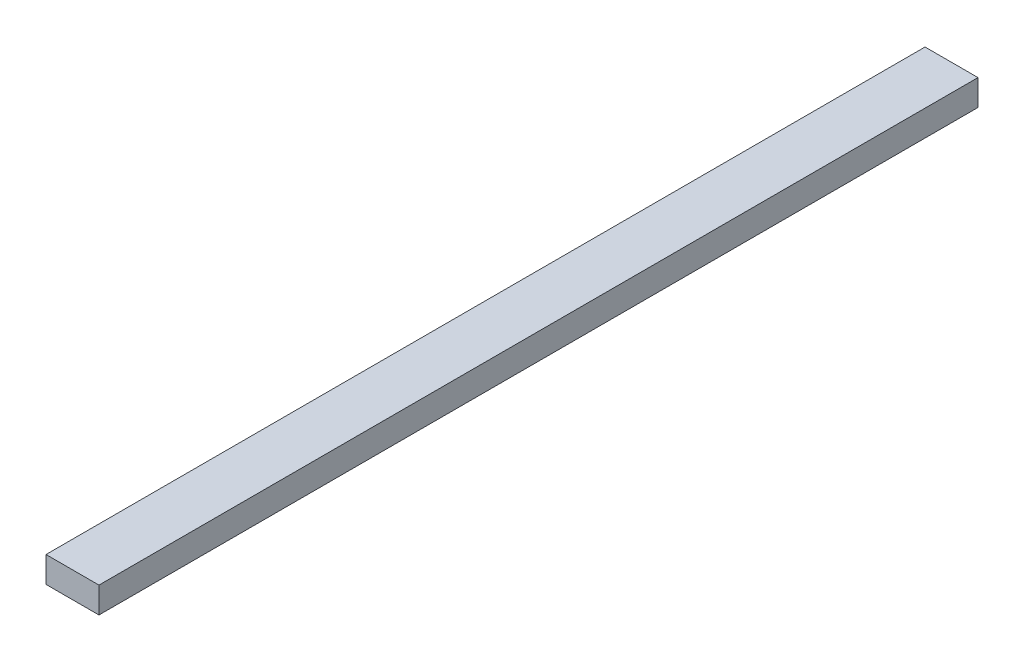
ISO-10303-21;
HEADER;
FILE_DESCRIPTION(('STEP AP214'),'2;1');
FILE_NAME('part.step','',(''),(''),'','','');
FILE_SCHEMA(('AUTOMOTIVE_DESIGN { 1 0 10303 214 1 1 1 1 }'));
ENDSEC;
DATA;
#1=APPLICATION_CONTEXT('core data for automotive mechanical design processes');
#2=APPLICATION_PROTOCOL_DEFINITION('international standard','automotive_design',2000,#1);
#3=PRODUCT_CONTEXT('',#1,'mechanical');
#4=PRODUCT('Part','Part','',(#3));
#5=PRODUCT_RELATED_PRODUCT_CATEGORY('part','',(#4));
#6=PRODUCT_DEFINITION_FORMATION('','',#4);
#7=PRODUCT_DEFINITION_CONTEXT('part definition',#1,'design');
#8=PRODUCT_DEFINITION('design','',#6,#7);
#9=PRODUCT_DEFINITION_SHAPE('','',#8);
#10=(LENGTH_UNIT() NAMED_UNIT(*) SI_UNIT(.MILLI.,.METRE.));
#11=(NAMED_UNIT(*) PLANE_ANGLE_UNIT() SI_UNIT($,.RADIAN.));
#12=(NAMED_UNIT(*) SI_UNIT($,.STERADIAN.) SOLID_ANGLE_UNIT());
#13=UNCERTAINTY_MEASURE_WITH_UNIT(LENGTH_MEASURE(1.E-05),#10,'distance_accuracy_value','');
#14=(GEOMETRIC_REPRESENTATION_CONTEXT(3) GLOBAL_UNCERTAINTY_ASSIGNED_CONTEXT((#13)) GLOBAL_UNIT_ASSIGNED_CONTEXT((#10,
#11,#12)) REPRESENTATION_CONTEXT('',''));
#15=CARTESIAN_POINT('',(0.,0.,0.));
#16=DIRECTION('',(0.,0.,1.));
#17=DIRECTION('',(1.,0.,0.));
#18=AXIS2_PLACEMENT_3D('',#15,#16,#17);
#19=CARTESIAN_POINT('',(23.5,11.5,780.));
#20=DIRECTION('',(-1.,0.,0.));
#21=DIRECTION('',(0.,0.,1.));
#22=AXIS2_PLACEMENT_3D('',#19,#20,#21);
#23=PLANE('',#22);
#24=DIRECTION('',(0.,1.,0.));
#25=VECTOR('',#24,1.);
#26=CARTESIAN_POINT('',(23.5,11.5,0.));
#27=LINE('',#26,#25);
#28=CARTESIAN_POINT('',(23.5,-11.5,0.));
#29=VERTEX_POINT('',#28);
#30=CARTESIAN_POINT('',(23.5,11.5,0.));
#31=VERTEX_POINT('',#30);
#32=EDGE_CURVE('E96',#29,#31,#27,.T.);
#33=ORIENTED_EDGE('',*,*,#32,.T.);
#34=DIRECTION('',(0.,0.,-1.));
#35=VECTOR('',#34,1.);
#36=CARTESIAN_POINT('',(23.5,11.5,780.));
#37=LINE('',#36,#35);
#38=CARTESIAN_POINT('',(23.5,11.5,780.));
#39=VERTEX_POINT('',#38);
#40=EDGE_CURVE('E11',#39,#31,#37,.T.);
#41=ORIENTED_EDGE('',*,*,#40,.F.);
#42=DIRECTION('',(0.,1.,0.));
#43=VECTOR('',#42,1.);
#44=CARTESIAN_POINT('',(23.5,11.5,780.));
#45=LINE('',#44,#43);
#46=CARTESIAN_POINT('',(23.5,-11.5,780.));
#47=VERTEX_POINT('',#46);
#48=EDGE_CURVE('E84',#47,#39,#45,.T.);
#49=ORIENTED_EDGE('',*,*,#48,.F.);
#50=DIRECTION('',(0.,0.,-1.));
#51=VECTOR('',#50,1.);
#52=CARTESIAN_POINT('',(23.5,-11.5,780.));
#53=LINE('',#52,#51);
#54=EDGE_CURVE('E92',#47,#29,#53,.T.);
#55=ORIENTED_EDGE('',*,*,#54,.T.);
#56=EDGE_LOOP('',(#33,#41,#49,#55));
#57=FACE_BOUND('',#56,.T.);
#58=ADVANCED_FACE('F33',(#57),#23,.F.);
#59=CARTESIAN_POINT('',(-23.5,11.5,780.));
#60=DIRECTION('',(0.,-1.,0.));
#61=DIRECTION('',(0.,0.,-1.));
#62=AXIS2_PLACEMENT_3D('',#59,#60,#61);
#63=PLANE('',#62);
#64=DIRECTION('',(-1.,0.,0.));
#65=VECTOR('',#64,1.);
#66=CARTESIAN_POINT('',(-23.5,11.5,0.));
#67=LINE('',#66,#65);
#68=CARTESIAN_POINT('',(-23.5,11.5,0.));
#69=VERTEX_POINT('',#68);
#70=EDGE_CURVE('E88',#31,#69,#67,.T.);
#71=ORIENTED_EDGE('',*,*,#70,.T.);
#72=DIRECTION('',(0.,0.,-1.));
#73=VECTOR('',#72,1.);
#74=CARTESIAN_POINT('',(-23.5,11.5,780.));
#75=LINE('',#74,#73);
#76=CARTESIAN_POINT('',(-23.5,11.5,780.));
#77=VERTEX_POINT('',#76);
#78=EDGE_CURVE('E41',#77,#69,#75,.T.);
#79=ORIENTED_EDGE('',*,*,#78,.F.);
#80=DIRECTION('',(-1.,0.,0.));
#81=VECTOR('',#80,1.);
#82=CARTESIAN_POINT('',(-23.5,11.5,780.));
#83=LINE('',#82,#81);
#84=EDGE_CURVE('E79',#39,#77,#83,.T.);
#85=ORIENTED_EDGE('',*,*,#84,.F.);
#86=ORIENTED_EDGE('',*,*,#40,.T.);
#87=EDGE_LOOP('',(#71,#79,#85,#86));
#88=FACE_BOUND('',#87,.T.);
#89=ADVANCED_FACE('F87',(#88),#63,.F.);
#90=CARTESIAN_POINT('',(-23.5,11.5,780.));
#91=DIRECTION('',(1.,0.,0.));
#92=DIRECTION('',(0.,1.,0.));
#93=AXIS2_PLACEMENT_3D('',#90,#91,#92);
#94=PLANE('',#93);
#95=DIRECTION('',(0.,-1.,0.));
#96=VECTOR('',#95,1.);
#97=CARTESIAN_POINT('',(-23.5,11.5,0.));
#98=LINE('',#97,#96);
#99=CARTESIAN_POINT('',(-23.5,-11.5,0.));
#100=VERTEX_POINT('',#99);
#101=EDGE_CURVE('E66',#69,#100,#98,.T.);
#102=ORIENTED_EDGE('',*,*,#101,.T.);
#103=DIRECTION('',(0.,0.,-1.));
#104=VECTOR('',#103,1.);
#105=CARTESIAN_POINT('',(-23.5,-11.5,780.));
#106=LINE('',#105,#104);
#107=CARTESIAN_POINT('',(-23.5,-11.5,780.));
#108=VERTEX_POINT('',#107);
#109=EDGE_CURVE('E89',#108,#100,#106,.T.);
#110=ORIENTED_EDGE('',*,*,#109,.F.);
#111=DIRECTION('',(0.,-1.,0.));
#112=VECTOR('',#111,1.);
#113=CARTESIAN_POINT('',(-23.5,11.5,780.));
#114=LINE('',#113,#112);
#115=EDGE_CURVE('E82',#77,#108,#114,.T.);
#116=ORIENTED_EDGE('',*,*,#115,.F.);
#117=ORIENTED_EDGE('',*,*,#78,.T.);
#118=EDGE_LOOP('',(#102,#110,#116,#117));
#119=FACE_BOUND('',#118,.T.);
#120=ADVANCED_FACE('F90',(#119),#94,.F.);
#121=CARTESIAN_POINT('',(-23.5,-11.5,780.));
#122=DIRECTION('',(0.,1.,0.));
#123=DIRECTION('',(0.,0.,1.));
#124=AXIS2_PLACEMENT_3D('',#121,#122,#123);
#125=PLANE('',#124);
#126=DIRECTION('',(1.,0.,0.));
#127=VECTOR('',#126,1.);
#128=CARTESIAN_POINT('',(-23.5,-11.5,0.));
#129=LINE('',#128,#127);
#130=EDGE_CURVE('E72',#100,#29,#129,.T.);
#131=ORIENTED_EDGE('',*,*,#130,.T.);
#132=ORIENTED_EDGE('',*,*,#54,.F.);
#133=DIRECTION('',(1.,0.,0.));
#134=VECTOR('',#133,1.);
#135=CARTESIAN_POINT('',(-23.5,-11.5,780.));
#136=LINE('',#135,#134);
#137=EDGE_CURVE('E49',#108,#47,#136,.T.);
#138=ORIENTED_EDGE('',*,*,#137,.F.);
#139=ORIENTED_EDGE('',*,*,#109,.T.);
#140=EDGE_LOOP('',(#131,#132,#138,#139));
#141=FACE_BOUND('',#140,.T.);
#142=ADVANCED_FACE('F103',(#141),#125,.F.);
#143=CARTESIAN_POINT('',(0.,0.,780.));
#144=DIRECTION('',(0.,0.,1.));
#145=DIRECTION('',(1.,0.,0.));
#146=AXIS2_PLACEMENT_3D('',#143,#144,#145);
#147=PLANE('',#146);
#148=ORIENTED_EDGE('',*,*,#48,.T.);
#149=ORIENTED_EDGE('',*,*,#84,.T.);
#150=ORIENTED_EDGE('',*,*,#115,.T.);
#151=ORIENTED_EDGE('',*,*,#137,.T.);
#152=EDGE_LOOP('',(#148,#149,#150,#151));
#153=FACE_BOUND('',#152,.T.);
#154=ADVANCED_FACE('F80',(#153),#147,.T.);
#155=CARTESIAN_POINT('',(0.,0.,0.));
#156=DIRECTION('',(0.,0.,1.));
#157=DIRECTION('',(1.,0.,0.));
#158=AXIS2_PLACEMENT_3D('',#155,#156,#157);
#159=PLANE('',#158);
#160=ORIENTED_EDGE('',*,*,#32,.F.);
#161=ORIENTED_EDGE('',*,*,#130,.F.);
#162=ORIENTED_EDGE('',*,*,#101,.F.);
#163=ORIENTED_EDGE('',*,*,#70,.F.);
#164=EDGE_LOOP('',(#160,#161,#162,#163));
#165=FACE_BOUND('',#164,.T.);
#166=ADVANCED_FACE('F106',(#165),#159,.F.);
#167=CLOSED_SHELL('',(#58,#89,#120,#142,#154,#166));
#168=MANIFOLD_SOLID_BREP('B2',#167);
#169=ADVANCED_BREP_SHAPE_REPRESENTATION('',(#18,#168),#14);
#170=SHAPE_DEFINITION_REPRESENTATION(#9,#169);
ENDSEC;
END-ISO-10303-21;
